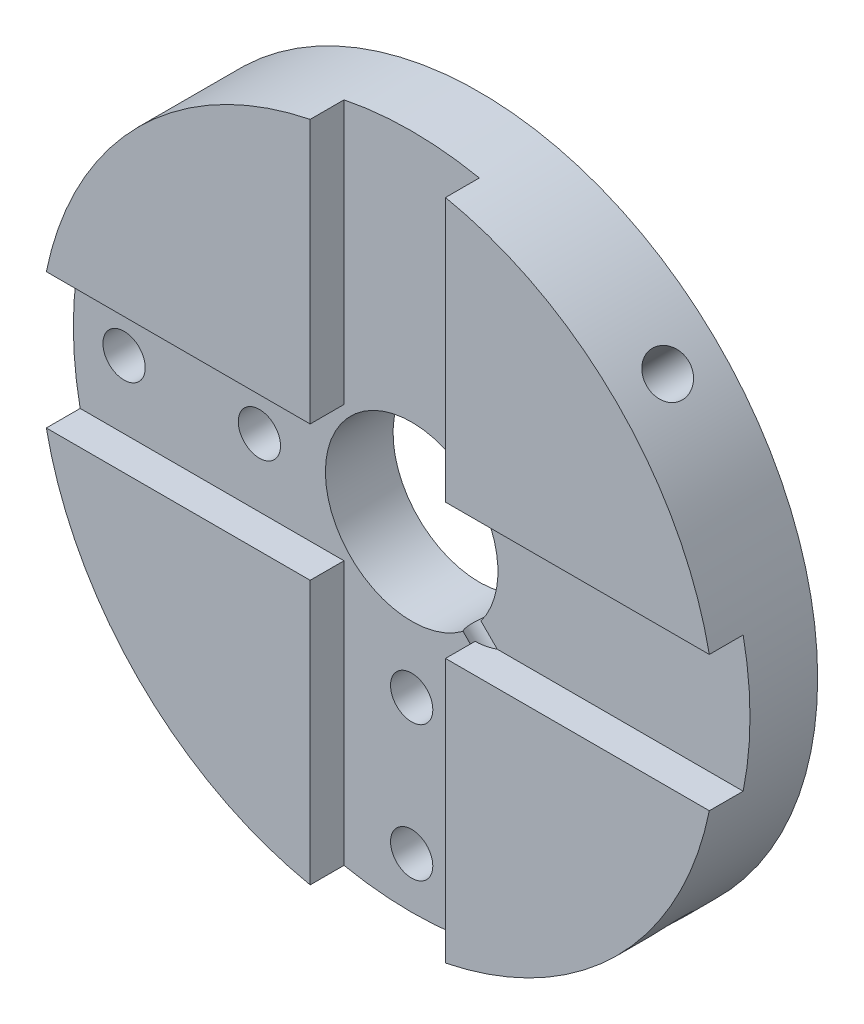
ISO-10303-21;
HEADER;
FILE_DESCRIPTION(('STEP AP214'),'2;1');
FILE_NAME('part.step','',(''),(''),'','','');
FILE_SCHEMA(('AUTOMOTIVE_DESIGN { 1 0 10303 214 1 1 1 1 }'));
ENDSEC;
DATA;
#1=APPLICATION_CONTEXT('core data for automotive mechanical design processes');
#2=APPLICATION_PROTOCOL_DEFINITION('international standard','automotive_design',2000,#1);
#3=PRODUCT_CONTEXT('',#1,'mechanical');
#4=PRODUCT('Part','Part','',(#3));
#5=PRODUCT_RELATED_PRODUCT_CATEGORY('part','',(#4));
#6=PRODUCT_DEFINITION_FORMATION('','',#4);
#7=PRODUCT_DEFINITION_CONTEXT('part definition',#1,'design');
#8=PRODUCT_DEFINITION('design','',#6,#7);
#9=PRODUCT_DEFINITION_SHAPE('','',#8);
#10=(LENGTH_UNIT() NAMED_UNIT(*) SI_UNIT(.MILLI.,.METRE.));
#11=(NAMED_UNIT(*) PLANE_ANGLE_UNIT() SI_UNIT($,.RADIAN.));
#12=(NAMED_UNIT(*) SI_UNIT($,.STERADIAN.) SOLID_ANGLE_UNIT());
#13=UNCERTAINTY_MEASURE_WITH_UNIT(LENGTH_MEASURE(1.E-05),#10,'distance_accuracy_value','');
#14=(GEOMETRIC_REPRESENTATION_CONTEXT(3) GLOBAL_UNCERTAINTY_ASSIGNED_CONTEXT((#13)) GLOBAL_UNIT_ASSIGNED_CONTEXT((#10,
#11,#12)) REPRESENTATION_CONTEXT('',''));
#15=CARTESIAN_POINT('',(0.,0.,0.));
#16=DIRECTION('',(0.,0.,1.));
#17=DIRECTION('',(1.,0.,0.));
#18=AXIS2_PLACEMENT_3D('',#15,#16,#17);
#19=CARTESIAN_POINT('',(0.,0.,8.));
#20=DIRECTION('',(0.,0.,-1.));
#21=DIRECTION('',(-1.,0.,0.));
#22=AXIS2_PLACEMENT_3D('',#19,#20,#21);
#23=PLANE('',#22);
#24=DIRECTION('',(-1.,0.,0.));
#25=VECTOR('',#24,1.);
#26=CARTESIAN_POINT('',(-23.0990360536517,4.00000000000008,8.));
#27=LINE('',#26,#25);
#28=CARTESIAN_POINT('',(19.5959179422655,3.99999999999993,8.));
#29=VERTEX_POINT('',#28);
#30=CARTESIAN_POINT('',(5.06066017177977,4.,8.));
#31=VERTEX_POINT('',#30);
#32=EDGE_CURVE('E142',#29,#31,#27,.T.);
#33=ORIENTED_EDGE('',*,*,#32,.T.);
#34=DIRECTION('',(-0.707106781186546,-0.707106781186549,0.));
#35=VECTOR('',#34,1.);
#36=CARTESIAN_POINT('',(0.530330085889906,-0.530330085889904,8.));
#37=LINE('',#36,#35);
#38=CARTESIAN_POINT('',(4.09736667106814,3.03670649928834,8.));
#39=VERTEX_POINT('',#38);
#40=EDGE_CURVE('E135',#31,#39,#37,.T.);
#41=ORIENTED_EDGE('',*,*,#40,.T.);
#42=CARTESIAN_POINT('',(0.,0.,8.));
#43=DIRECTION('',(0.,0.,-1.));
#44=DIRECTION('',(-1.,0.,0.));
#45=AXIS2_PLACEMENT_3D('',#42,#43,#44);
#46=CIRCLE('',#45,5.1);
#47=CARTESIAN_POINT('',(4.09736667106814,-3.03670649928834,8.));
#48=VERTEX_POINT('',#47);
#49=EDGE_CURVE('E44',#39,#48,#46,.T.);
#50=ORIENTED_EDGE('',*,*,#49,.T.);
#51=DIRECTION('',(-0.707106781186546,0.707106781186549,0.));
#52=VECTOR('',#51,1.);
#53=CARTESIAN_POINT('',(0.530330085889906,0.530330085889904,8.));
#54=LINE('',#53,#52);
#55=CARTESIAN_POINT('',(5.06066017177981,-4.,8.));
#56=VERTEX_POINT('',#55);
#57=EDGE_CURVE('E227',#48,#56,#54,.F.);
#58=ORIENTED_EDGE('',*,*,#57,.T.);
#59=DIRECTION('',(1.,0.,0.));
#60=VECTOR('',#59,1.);
#61=CARTESIAN_POINT('',(-23.0990360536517,-3.99999999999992,8.));
#62=LINE('',#61,#60);
#63=CARTESIAN_POINT('',(19.5959179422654,-4.00000000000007,8.));
#64=VERTEX_POINT('',#63);
#65=EDGE_CURVE('E329',#56,#64,#62,.T.);
#66=ORIENTED_EDGE('',*,*,#65,.T.);
#67=CARTESIAN_POINT('',(0.,0.,8.));
#68=DIRECTION('',(0.,0.,-1.));
#69=DIRECTION('',(-1.,0.,0.));
#70=AXIS2_PLACEMENT_3D('',#67,#68,#69);
#71=CIRCLE('',#70,20.);
#72=EDGE_CURVE('E309',#29,#64,#71,.T.);
#73=ORIENTED_EDGE('',*,*,#72,.F.);
#74=EDGE_LOOP('',(#33,#41,#50,#58,#66,#73));
#75=FACE_BOUND('',#74,.T.);
#76=ADVANCED_FACE('F16',(#75),#23,.F.);
#77=CARTESIAN_POINT('',(-2.41055287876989E-13,-9.,8.));
#78=DIRECTION('',(0.,0.,1.));
#79=DIRECTION('',(1.,0.,0.));
#80=AXIS2_PLACEMENT_3D('',#77,#78,#79);
#81=CIRCLE('',#80,1.25);
#82=CARTESIAN_POINT('',(1.24999999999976,-9.,8.));
#83=VERTEX_POINT('',#82);
#84=EDGE_CURVE('E166',#83,#83,#81,.T.);
#85=ORIENTED_EDGE('',*,*,#84,.F.);
#86=EDGE_LOOP('',(#85));
#87=FACE_BOUND('',#86,.T.);
#88=CARTESIAN_POINT('',(-3.26849241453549E-13,-17.,8.));
#89=DIRECTION('',(0.,0.,1.));
#90=DIRECTION('',(1.,0.,0.));
#91=AXIS2_PLACEMENT_3D('',#88,#89,#90);
#92=CIRCLE('',#91,1.25);
#93=CARTESIAN_POINT('',(1.24999999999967,-17.,8.));
#94=VERTEX_POINT('',#93);
#95=EDGE_CURVE('E165',#94,#94,#92,.T.);
#96=ORIENTED_EDGE('',*,*,#95,.F.);
#97=EDGE_LOOP('',(#96));
#98=FACE_BOUND('',#97,.T.);
#99=CARTESIAN_POINT('',(-9.,1.46785291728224E-13,8.));
#100=DIRECTION('',(0.,0.,1.));
#101=DIRECTION('',(1.,0.,0.));
#102=AXIS2_PLACEMENT_3D('',#99,#100,#101);
#103=CIRCLE('',#102,1.25);
#104=CARTESIAN_POINT('',(-7.75,1.46785291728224E-13,8.));
#105=VERTEX_POINT('',#104);
#106=EDGE_CURVE('E170',#105,#105,#103,.T.);
#107=ORIENTED_EDGE('',*,*,#106,.F.);
#108=EDGE_LOOP('',(#107));
#109=FACE_BOUND('',#108,.T.);
#110=CARTESIAN_POINT('',(3.03670649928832,-4.09736667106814,8.));
#111=VERTEX_POINT('',#110);
#112=CARTESIAN_POINT('',(3.03670649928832,4.09736667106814,8.));
#113=VERTEX_POINT('',#112);
#114=EDGE_CURVE('E149',#111,#113,#46,.T.);
#115=ORIENTED_EDGE('',*,*,#114,.T.);
#116=DIRECTION('',(-0.707106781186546,-0.707106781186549,0.));
#117=VECTOR('',#116,1.);
#118=CARTESIAN_POINT('',(-0.530330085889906,0.530330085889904,8.));
#119=LINE('',#118,#117);
#120=CARTESIAN_POINT('',(4.,5.06066017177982,8.));
#121=VERTEX_POINT('',#120);
#122=EDGE_CURVE('E36',#113,#121,#119,.F.);
#123=ORIENTED_EDGE('',*,*,#122,.T.);
#124=DIRECTION('',(0.,1.,0.));
#125=VECTOR('',#124,1.);
#126=CARTESIAN_POINT('',(4.,-23.0990360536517,8.));
#127=LINE('',#126,#125);
#128=CARTESIAN_POINT('',(4.,19.5959179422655,8.));
#129=VERTEX_POINT('',#128);
#130=EDGE_CURVE('E249',#121,#129,#127,.T.);
#131=ORIENTED_EDGE('',*,*,#130,.T.);
#132=CARTESIAN_POINT('',(0.,0.,8.));
#133=DIRECTION('',(0.,0.,-1.));
#134=DIRECTION('',(-1.,0.,0.));
#135=AXIS2_PLACEMENT_3D('',#132,#133,#134);
#136=CIRCLE('',#135,20.);
#137=CARTESIAN_POINT('',(-4.,19.5959179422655,8.));
#138=VERTEX_POINT('',#137);
#139=EDGE_CURVE('E266',#138,#129,#136,.T.);
#140=ORIENTED_EDGE('',*,*,#139,.F.);
#141=DIRECTION('',(0.,-1.,0.));
#142=VECTOR('',#141,1.);
#143=CARTESIAN_POINT('',(-4.,-23.0990360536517,8.));
#144=LINE('',#143,#142);
#145=CARTESIAN_POINT('',(-4.,4.,8.));
#146=VERTEX_POINT('',#145);
#147=EDGE_CURVE('E251',#138,#146,#144,.T.);
#148=ORIENTED_EDGE('',*,*,#147,.T.);
#149=CARTESIAN_POINT('',(-19.5959179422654,4.00000000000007,8.));
#150=VERTEX_POINT('',#149);
#151=EDGE_CURVE('E291',#146,#150,#27,.T.);
#152=ORIENTED_EDGE('',*,*,#151,.T.);
#153=CARTESIAN_POINT('',(-19.5959179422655,-3.99999999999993,8.));
#154=VERTEX_POINT('',#153);
#155=EDGE_CURVE('E306',#154,#150,#71,.T.);
#156=ORIENTED_EDGE('',*,*,#155,.F.);
#157=CARTESIAN_POINT('',(-4.,-4.,8.));
#158=VERTEX_POINT('',#157);
#159=EDGE_CURVE('E320',#154,#158,#62,.T.);
#160=ORIENTED_EDGE('',*,*,#159,.T.);
#161=CARTESIAN_POINT('',(-4.,-19.5959179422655,8.));
#162=VERTEX_POINT('',#161);
#163=EDGE_CURVE('E248',#158,#162,#144,.T.);
#164=ORIENTED_EDGE('',*,*,#163,.T.);
#165=CARTESIAN_POINT('',(4.,-19.5959179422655,8.));
#166=VERTEX_POINT('',#165);
#167=EDGE_CURVE('E247',#166,#162,#136,.T.);
#168=ORIENTED_EDGE('',*,*,#167,.F.);
#169=CARTESIAN_POINT('',(4.,-5.06066017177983,8.));
#170=VERTEX_POINT('',#169);
#171=EDGE_CURVE('E240',#166,#170,#127,.T.);
#172=ORIENTED_EDGE('',*,*,#171,.T.);
#173=DIRECTION('',(-0.707106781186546,0.707106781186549,0.));
#174=VECTOR('',#173,1.);
#175=CARTESIAN_POINT('',(-0.530330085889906,-0.530330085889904,8.));
#176=LINE('',#175,#174);
#177=EDGE_CURVE('E229',#170,#111,#176,.T.);
#178=ORIENTED_EDGE('',*,*,#177,.T.);
#179=EDGE_LOOP('',(#115,#123,#131,#140,#148,#152,#156,#160,#164,#168,#172,#178));
#180=FACE_BOUND('',#179,.T.);
#181=CARTESIAN_POINT('',(-17.,1.48783693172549E-13,8.));
#182=DIRECTION('',(0.,0.,1.));
#183=DIRECTION('',(1.,0.,0.));
#184=AXIS2_PLACEMENT_3D('',#181,#182,#183);
#185=CIRCLE('',#184,1.25);
#186=CARTESIAN_POINT('',(-15.75,1.48783693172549E-13,8.));
#187=VERTEX_POINT('',#186);
#188=EDGE_CURVE('E174',#187,#187,#185,.T.);
#189=ORIENTED_EDGE('',*,*,#188,.F.);
#190=EDGE_LOOP('',(#189));
#191=FACE_BOUND('',#190,.T.);
#192=ADVANCED_FACE('F244',(#87,#98,#109,#180,#191),#23,.F.);
#193=CARTESIAN_POINT('',(0.,0.,10.));
#194=DIRECTION('',(0.,0.,1.));
#195=DIRECTION('',(1.,0.,0.));
#196=AXIS2_PLACEMENT_3D('',#193,#194,#195);
#197=PLANE('',#196);
#198=DIRECTION('',(1.,0.,0.));
#199=VECTOR('',#198,1.);
#200=CARTESIAN_POINT('',(-23.0990360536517,-3.99999999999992,10.));
#201=LINE('',#200,#199);
#202=CARTESIAN_POINT('',(4.,-4.,10.));
#203=VERTEX_POINT('',#202);
#204=CARTESIAN_POINT('',(19.5959179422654,-4.00000000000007,10.));
#205=VERTEX_POINT('',#204);
#206=EDGE_CURVE('E178',#203,#205,#201,.T.);
#207=ORIENTED_EDGE('',*,*,#206,.F.);
#208=DIRECTION('',(0.,1.,0.));
#209=VECTOR('',#208,1.);
#210=CARTESIAN_POINT('',(4.,-23.0990360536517,10.));
#211=LINE('',#210,#209);
#212=CARTESIAN_POINT('',(4.,-19.5959179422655,10.));
#213=VERTEX_POINT('',#212);
#214=EDGE_CURVE('E261',#213,#203,#211,.T.);
#215=ORIENTED_EDGE('',*,*,#214,.F.);
#216=CARTESIAN_POINT('',(0.,0.,10.));
#217=DIRECTION('',(0.,0.,1.));
#218=DIRECTION('',(1.,0.,0.));
#219=AXIS2_PLACEMENT_3D('',#216,#217,#218);
#220=CIRCLE('',#219,20.);
#221=EDGE_CURVE('E156',#213,#205,#220,.T.);
#222=ORIENTED_EDGE('',*,*,#221,.T.);
#223=EDGE_LOOP('',(#207,#215,#222));
#224=FACE_BOUND('',#223,.T.);
#225=ADVANCED_FACE('F284',(#224),#197,.T.);
#226=CARTESIAN_POINT('',(-19.5959179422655,-3.99999999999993,10.));
#227=VERTEX_POINT('',#226);
#228=CARTESIAN_POINT('',(-4.,-4.,10.));
#229=VERTEX_POINT('',#228);
#230=EDGE_CURVE('E286',#227,#229,#201,.T.);
#231=ORIENTED_EDGE('',*,*,#230,.F.);
#232=CARTESIAN_POINT('',(-4.,-19.5959179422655,10.));
#233=VERTEX_POINT('',#232);
#234=EDGE_CURVE('E154',#227,#233,#220,.T.);
#235=ORIENTED_EDGE('',*,*,#234,.T.);
#236=DIRECTION('',(0.,-1.,0.));
#237=VECTOR('',#236,1.);
#238=CARTESIAN_POINT('',(-4.,-23.0990360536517,10.));
#239=LINE('',#238,#237);
#240=EDGE_CURVE('E262',#229,#233,#239,.T.);
#241=ORIENTED_EDGE('',*,*,#240,.F.);
#242=EDGE_LOOP('',(#231,#235,#241));
#243=FACE_BOUND('',#242,.T.);
#244=ADVANCED_FACE('F323',(#243),#197,.T.);
#245=DIRECTION('',(-1.,0.,0.));
#246=VECTOR('',#245,1.);
#247=CARTESIAN_POINT('',(-23.0990360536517,4.00000000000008,10.));
#248=LINE('',#247,#246);
#249=CARTESIAN_POINT('',(19.5959179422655,3.99999999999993,10.));
#250=VERTEX_POINT('',#249);
#251=CARTESIAN_POINT('',(4.,4.,10.));
#252=VERTEX_POINT('',#251);
#253=EDGE_CURVE('E294',#250,#252,#248,.T.);
#254=ORIENTED_EDGE('',*,*,#253,.F.);
#255=CARTESIAN_POINT('',(4.,19.5959179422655,10.));
#256=VERTEX_POINT('',#255);
#257=EDGE_CURVE('E157',#250,#256,#220,.T.);
#258=ORIENTED_EDGE('',*,*,#257,.T.);
#259=EDGE_CURVE('E258',#252,#256,#211,.T.);
#260=ORIENTED_EDGE('',*,*,#259,.F.);
#261=EDGE_LOOP('',(#254,#258,#260));
#262=FACE_BOUND('',#261,.T.);
#263=ADVANCED_FACE('F409',(#262),#197,.T.);
#264=CARTESIAN_POINT('',(-4.,4.,10.));
#265=VERTEX_POINT('',#264);
#266=CARTESIAN_POINT('',(-19.5959179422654,4.00000000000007,10.));
#267=VERTEX_POINT('',#266);
#268=EDGE_CURVE('E288',#265,#267,#248,.T.);
#269=ORIENTED_EDGE('',*,*,#268,.F.);
#270=CARTESIAN_POINT('',(-4.,19.5959179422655,10.));
#271=VERTEX_POINT('',#270);
#272=EDGE_CURVE('E253',#271,#265,#239,.T.);
#273=ORIENTED_EDGE('',*,*,#272,.F.);
#274=EDGE_CURVE('E150',#271,#267,#220,.T.);
#275=ORIENTED_EDGE('',*,*,#274,.T.);
#276=EDGE_LOOP('',(#269,#273,#275));
#277=FACE_BOUND('',#276,.T.);
#278=ADVANCED_FACE('F217',(#277),#197,.T.);
#279=CARTESIAN_POINT('',(0.,0.,4.));
#280=DIRECTION('',(0.,0.,1.));
#281=DIRECTION('',(1.,0.,0.));
#282=AXIS2_PLACEMENT_3D('',#279,#280,#281);
#283=PLANE('',#282);
#284=CARTESIAN_POINT('',(-2.41055287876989E-13,-9.,4.));
#285=DIRECTION('',(0.,0.,1.));
#286=DIRECTION('',(1.,0.,0.));
#287=AXIS2_PLACEMENT_3D('',#284,#285,#286);
#288=CIRCLE('',#287,1.25);
#289=CARTESIAN_POINT('',(1.24999999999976,-9.,4.));
#290=VERTEX_POINT('',#289);
#291=EDGE_CURVE('E162',#290,#290,#288,.T.);
#292=ORIENTED_EDGE('',*,*,#291,.T.);
#293=EDGE_LOOP('',(#292));
#294=FACE_BOUND('',#293,.T.);
#295=CARTESIAN_POINT('',(-3.26849241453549E-13,-17.,4.));
#296=DIRECTION('',(0.,0.,1.));
#297=DIRECTION('',(1.,0.,0.));
#298=AXIS2_PLACEMENT_3D('',#295,#296,#297);
#299=CIRCLE('',#298,1.25);
#300=CARTESIAN_POINT('',(1.24999999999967,-17.,4.));
#301=VERTEX_POINT('',#300);
#302=EDGE_CURVE('E167',#301,#301,#299,.T.);
#303=ORIENTED_EDGE('',*,*,#302,.T.);
#304=EDGE_LOOP('',(#303));
#305=FACE_BOUND('',#304,.T.);
#306=CARTESIAN_POINT('',(-9.,1.46785291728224E-13,4.));
#307=DIRECTION('',(0.,0.,1.));
#308=DIRECTION('',(1.,0.,0.));
#309=AXIS2_PLACEMENT_3D('',#306,#307,#308);
#310=CIRCLE('',#309,1.25);
#311=CARTESIAN_POINT('',(-7.75,1.46785291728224E-13,4.));
#312=VERTEX_POINT('',#311);
#313=EDGE_CURVE('E171',#312,#312,#310,.T.);
#314=ORIENTED_EDGE('',*,*,#313,.T.);
#315=EDGE_LOOP('',(#314));
#316=FACE_BOUND('',#315,.T.);
#317=CARTESIAN_POINT('',(-17.,1.48783693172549E-13,4.));
#318=DIRECTION('',(0.,0.,1.));
#319=DIRECTION('',(1.,0.,0.));
#320=AXIS2_PLACEMENT_3D('',#317,#318,#319);
#321=CIRCLE('',#320,1.25);
#322=CARTESIAN_POINT('',(-15.75,1.48783693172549E-13,4.));
#323=VERTEX_POINT('',#322);
#324=EDGE_CURVE('E175',#323,#323,#321,.T.);
#325=ORIENTED_EDGE('',*,*,#324,.T.);
#326=EDGE_LOOP('',(#325));
#327=FACE_BOUND('',#326,.T.);
#328=CARTESIAN_POINT('',(0.,0.,4.));
#329=DIRECTION('',(0.,0.,1.));
#330=DIRECTION('',(1.,0.,0.));
#331=AXIS2_PLACEMENT_3D('',#328,#329,#330);
#332=CIRCLE('',#331,20.);
#333=CARTESIAN_POINT('',(20.,0.,4.));
#334=VERTEX_POINT('',#333);
#335=EDGE_CURVE('E179',#334,#334,#332,.T.);
#336=ORIENTED_EDGE('',*,*,#335,.F.);
#337=EDGE_LOOP('',(#336));
#338=FACE_BOUND('',#337,.T.);
#339=CARTESIAN_POINT('',(0.,0.,4.));
#340=DIRECTION('',(0.,0.,1.));
#341=DIRECTION('',(1.,0.,0.));
#342=AXIS2_PLACEMENT_3D('',#339,#340,#341);
#343=CIRCLE('',#342,5.1);
#344=CARTESIAN_POINT('',(5.1,0.,4.));
#345=VERTEX_POINT('',#344);
#346=EDGE_CURVE('E182',#345,#345,#343,.T.);
#347=ORIENTED_EDGE('',*,*,#346,.T.);
#348=EDGE_LOOP('',(#347));
#349=FACE_BOUND('',#348,.T.);
#350=ADVANCED_FACE('F18',(#294,#305,#316,#327,#338,#349),#283,.F.);
#351=CARTESIAN_POINT('',(0.,0.,10.));
#352=DIRECTION('',(0.,0.,-1.));
#353=DIRECTION('',(-1.,0.,0.));
#354=AXIS2_PLACEMENT_3D('',#351,#352,#353);
#355=CYLINDRICAL_SURFACE('',#354,20.);
#356=CARTESIAN_POINT('',(14.9983707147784,13.2306037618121,7.));
#357=CARTESIAN_POINT('',(14.9983689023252,13.2306063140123,7.07013944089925));
#358=CARTESIAN_POINT('',(14.9944465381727,13.2350563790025,7.14032799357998));
#359=CARTESIAN_POINT('',(14.9788340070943,13.2527229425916,7.27876701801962));
#360=CARTESIAN_POINT('',(14.9671347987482,13.2659496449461,7.34701513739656));
#361=CARTESIAN_POINT('',(14.9362411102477,13.3007232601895,7.4795479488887));
#362=CARTESIAN_POINT('',(14.917050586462,13.3222657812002,7.54383471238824));
#363=CARTESIAN_POINT('',(14.8716263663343,13.3729533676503,7.6666442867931));
#364=CARTESIAN_POINT('',(14.8453942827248,13.4020966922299,7.72516841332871));
#365=CARTESIAN_POINT('',(14.7864657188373,13.4670840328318,7.83489620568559));
#366=CARTESIAN_POINT('',(14.7537607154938,13.5029368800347,7.88609006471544));
#367=CARTESIAN_POINT('',(14.6826984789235,13.5801735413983,7.97962019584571));
#368=CARTESIAN_POINT('',(14.6443410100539,13.6215575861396,8.02195609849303));
#369=CARTESIAN_POINT('',(14.5628975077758,13.708594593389,8.09659846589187));
#370=CARTESIAN_POINT('',(14.5198077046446,13.7542509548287,8.12889685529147));
#371=CARTESIAN_POINT('',(14.4300380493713,13.8484016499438,8.18249564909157));
#372=CARTESIAN_POINT('',(14.383358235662,13.8968959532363,8.20379617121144));
#373=CARTESIAN_POINT('',(14.2877226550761,13.9952018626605,8.23476748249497));
#374=CARTESIAN_POINT('',(14.2387699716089,14.0450116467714,8.24445357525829));
#375=CARTESIAN_POINT('',(14.1398886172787,14.1445562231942,8.25196833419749));
#376=CARTESIAN_POINT('',(14.0899599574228,14.194291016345,8.24979713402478));
#377=CARTESIAN_POINT('',(13.9906259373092,14.2922092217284,8.23367156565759));
#378=CARTESIAN_POINT('',(13.9412199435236,14.3403947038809,8.21973366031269));
#379=CARTESIAN_POINT('',(13.8443117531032,14.4339728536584,8.18049587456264));
#380=CARTESIAN_POINT('',(13.7968095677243,14.479365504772,8.15519592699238));
#381=CARTESIAN_POINT('',(13.7051076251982,14.5661944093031,8.09393358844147));
#382=CARTESIAN_POINT('',(13.6609102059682,14.6076278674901,8.05796373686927));
#383=CARTESIAN_POINT('',(13.5772167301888,14.6854505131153,7.97638807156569));
#384=CARTESIAN_POINT('',(13.5377207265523,14.721839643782,7.93078214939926));
#385=CARTESIAN_POINT('',(13.4646108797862,14.7887362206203,7.83113594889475));
#386=CARTESIAN_POINT('',(13.4310072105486,14.8192335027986,7.77708138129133));
#387=CARTESIAN_POINT('',(13.3708479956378,14.8735359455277,7.66212236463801));
#388=CARTESIAN_POINT('',(13.3442924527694,14.8973411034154,7.60121791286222));
#389=CARTESIAN_POINT('',(13.2991002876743,14.9376990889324,7.47427884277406));
#390=CARTESIAN_POINT('',(13.2804641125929,14.9542515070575,7.40824393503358));
#391=CARTESIAN_POINT('',(13.2517353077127,14.9797157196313,7.27292263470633));
#392=CARTESIAN_POINT('',(13.2416425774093,14.9886276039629,7.20363628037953));
#393=CARTESIAN_POINT('',(13.230350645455,14.9985959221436,7.06390431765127));
#394=CARTESIAN_POINT('',(13.2291364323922,14.9996656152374,6.99346086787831));
#395=CARTESIAN_POINT('',(13.2356028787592,14.9939599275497,6.85330407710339));
#396=CARTESIAN_POINT('',(13.2432834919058,14.9871845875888,6.78359073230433));
#397=CARTESIAN_POINT('',(13.2672708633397,14.9659539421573,6.64692958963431));
#398=CARTESIAN_POINT('',(13.2835707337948,14.9515047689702,6.5799796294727));
#399=CARTESIAN_POINT('',(13.3242489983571,14.9152648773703,6.45067898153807));
#400=CARTESIAN_POINT('',(13.3486274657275,14.8934740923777,6.38832833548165));
#401=CARTESIAN_POINT('',(13.4047000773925,14.8430264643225,6.26990439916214));
#402=CARTESIAN_POINT('',(13.4364039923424,14.8143604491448,6.21383964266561));
#403=CARTESIAN_POINT('',(13.5060846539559,14.7508607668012,6.10966492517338));
#404=CARTESIAN_POINT('',(13.5440614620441,14.7160270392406,6.06155504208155));
#405=CARTESIAN_POINT('',(13.6251408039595,14.64098997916,5.97458821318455));
#406=CARTESIAN_POINT('',(13.6682503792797,14.6007792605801,5.93574420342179));
#407=CARTESIAN_POINT('',(13.7582105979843,14.516041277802,5.86850028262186));
#408=CARTESIAN_POINT('',(13.805061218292,14.4715140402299,5.8401003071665));
#409=CARTESIAN_POINT('',(13.9010412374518,14.3793418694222,5.79457312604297));
#410=CARTESIAN_POINT('',(13.9501689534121,14.3316992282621,5.77743773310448));
#411=CARTESIAN_POINT('',(14.0492748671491,14.2345596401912,5.75489933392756));
#412=CARTESIAN_POINT('',(14.0992530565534,14.1850627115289,5.74949621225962));
#413=CARTESIAN_POINT('',(14.1985304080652,14.0856898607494,5.75057685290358));
#414=CARTESIAN_POINT('',(14.24783058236,14.035814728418,5.75704037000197));
#415=CARTESIAN_POINT('',(14.3444630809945,13.9370425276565,5.78162883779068));
#416=CARTESIAN_POINT('',(14.3917954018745,13.888145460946,5.79975380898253));
#417=CARTESIAN_POINT('',(14.4832164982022,13.7927809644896,5.84714612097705));
#418=CARTESIAN_POINT('',(14.5273052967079,13.7463135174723,5.8764133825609));
#419=CARTESIAN_POINT('',(14.6110940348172,13.6572206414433,5.94525665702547));
#420=CARTESIAN_POINT('',(14.6507940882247,13.6145951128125,5.98483240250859));
#421=CARTESIAN_POINT('',(14.7248710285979,13.5344435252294,6.07324399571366));
#422=CARTESIAN_POINT('',(14.7592393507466,13.4969256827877,6.12209446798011));
#423=CARTESIAN_POINT('',(14.8217465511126,13.4282534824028,6.22764940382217));
#424=CARTESIAN_POINT('',(14.8498839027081,13.3971006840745,6.28435578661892));
#425=CARTESIAN_POINT('',(14.8992782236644,13.3421467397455,6.40407768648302));
#426=CARTESIAN_POINT('',(14.9205266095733,13.3183547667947,6.46710094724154));
#427=CARTESIAN_POINT('',(14.9555773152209,13.2789837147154,6.5975656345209));
#428=CARTESIAN_POINT('',(14.9693883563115,13.2633950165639,6.66500178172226));
#429=CARTESIAN_POINT('',(14.9856600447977,13.2450019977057,6.77737541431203));
#430=CARTESIAN_POINT('',(14.990421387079,13.2396106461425,6.82158651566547));
#431=CARTESIAN_POINT('',(14.9967772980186,13.2324107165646,6.91052508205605));
#432=CARTESIAN_POINT('',(14.9983718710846,13.2306021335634,6.95525254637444));
#433=CARTESIAN_POINT('',(14.9983707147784,13.2306037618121,7.));
#434=B_SPLINE_CURVE_WITH_KNOTS('',3,(#356,#357,#358,#359,#360,#361,#362,#363,#364,#365,#366,
#367,#368,#369,#370,#371,#372,#373,#374,#375,#376,#377,#378,#379,#380,#381,#382,#383,#384,#385,
#386,#387,#388,#389,#390,#391,#392,#393,#394,#395,#396,#397,#398,#399,#400,#401,#402,#403,#404,
#405,#406,#407,#408,#409,#410,#411,#412,#413,#414,#415,#416,#417,#418,#419,#420,#421,#422,#423,
#424,#425,#426,#427,#428,#429,#430,#431,#432,#433),.UNSPECIFIED.,.T.,.F.,(4,2,2,2,2,2,2,2,2,2,2,
2,2,2,2,2,2,2,2,2,2,2,2,2,2,2,2,2,2,2,2,2,2,2,2,2,2,2,4),(0.,0.21025496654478,0.420754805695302,
0.631143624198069,0.841484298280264,1.05210379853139,1.26273208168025,1.4735293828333,
1.68432442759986,1.89484141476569,2.10535602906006,2.31557659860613,2.5257984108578,
2.73616756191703,2.9465390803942,3.15727033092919,3.36800166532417,3.57874489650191,
3.78948564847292,3.99987000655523,4.21025326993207,4.42046866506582,4.63068596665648,
4.8411852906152,5.05168667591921,5.26248024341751,5.47327251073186,5.68391140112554,
5.89454821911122,6.10482601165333,6.31510417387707,6.52538084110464,6.73565205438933,
6.94625762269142,7.15691473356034,7.36783331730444,7.57850402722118,7.71264235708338,
7.84678050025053),.UNSPECIFIED.);
#435=CARTESIAN_POINT('',(14.9983707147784,13.2306037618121,7.));
#436=VERTEX_POINT('',#435);
#437=EDGE_CURVE('E220',#436,#436,#434,.T.);
#438=ORIENTED_EDGE('',*,*,#437,.T.);
#439=EDGE_LOOP('',(#438));
#440=FACE_BOUND('',#439,.T.);
#441=CARTESIAN_POINT('',(13.2306037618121,-14.9983707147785,7.));
#442=CARTESIAN_POINT('',(13.2306063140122,-14.9983689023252,7.07013944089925));
#443=CARTESIAN_POINT('',(13.2350563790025,-14.9944465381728,7.14032799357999));
#444=CARTESIAN_POINT('',(13.2527229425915,-14.9788340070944,7.27876701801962));
#445=CARTESIAN_POINT('',(13.2659496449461,-14.9671347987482,7.34701513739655));
#446=CARTESIAN_POINT('',(13.3007232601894,-14.9362411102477,7.4795479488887));
#447=CARTESIAN_POINT('',(13.3222657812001,-14.917050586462,7.54383471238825));
#448=CARTESIAN_POINT('',(13.3729533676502,-14.8716263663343,7.66664428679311));
#449=CARTESIAN_POINT('',(13.4020966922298,-14.8453942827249,7.72516841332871));
#450=CARTESIAN_POINT('',(13.4670840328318,-14.7864657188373,7.83489620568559));
#451=CARTESIAN_POINT('',(13.5029368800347,-14.7537607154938,7.88609006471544));
#452=CARTESIAN_POINT('',(13.5801735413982,-14.6826984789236,7.97962019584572));
#453=CARTESIAN_POINT('',(13.6215575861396,-14.644341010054,8.02195609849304));
#454=CARTESIAN_POINT('',(13.708594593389,-14.5628975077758,8.09659846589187));
#455=CARTESIAN_POINT('',(13.7542509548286,-14.5198077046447,8.12889685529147));
#456=CARTESIAN_POINT('',(13.8484016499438,-14.4300380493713,8.18249564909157));
#457=CARTESIAN_POINT('',(13.8968959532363,-14.3833582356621,8.20379617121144));
#458=CARTESIAN_POINT('',(13.9952018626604,-14.2877226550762,8.23476748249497));
#459=CARTESIAN_POINT('',(14.0450116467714,-14.238769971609,8.24445357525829));
#460=CARTESIAN_POINT('',(14.1445562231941,-14.1398886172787,8.2519683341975));
#461=CARTESIAN_POINT('',(14.1942910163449,-14.0899599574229,8.24979713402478));
#462=CARTESIAN_POINT('',(14.2922092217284,-13.9906259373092,8.23367156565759));
#463=CARTESIAN_POINT('',(14.3403947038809,-13.9412199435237,8.21973366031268));
#464=CARTESIAN_POINT('',(14.4339728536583,-13.8443117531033,8.18049587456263));
#465=CARTESIAN_POINT('',(14.4793655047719,-13.7968095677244,8.15519592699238));
#466=CARTESIAN_POINT('',(14.5661944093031,-13.7051076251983,8.09393358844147));
#467=CARTESIAN_POINT('',(14.60762786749,-13.6609102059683,8.05796373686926));
#468=CARTESIAN_POINT('',(14.6854505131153,-13.5772167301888,7.97638807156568));
#469=CARTESIAN_POINT('',(14.7218396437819,-13.5377207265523,7.93078214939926));
#470=CARTESIAN_POINT('',(14.7887362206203,-13.4646108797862,7.83113594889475));
#471=CARTESIAN_POINT('',(14.8192335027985,-13.4310072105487,7.77708138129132));
#472=CARTESIAN_POINT('',(14.8735359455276,-13.3708479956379,7.662122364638));
#473=CARTESIAN_POINT('',(14.8973411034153,-13.3442924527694,7.60121791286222));
#474=CARTESIAN_POINT('',(14.9376990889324,-13.2991002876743,7.47427884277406));
#475=CARTESIAN_POINT('',(14.9542515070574,-13.2804641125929,7.40824393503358));
#476=CARTESIAN_POINT('',(14.9797157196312,-13.2517353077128,7.27292263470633));
#477=CARTESIAN_POINT('',(14.9886276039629,-13.2416425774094,7.20363628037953));
#478=CARTESIAN_POINT('',(14.9985959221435,-13.230350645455,7.06390431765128));
#479=CARTESIAN_POINT('',(14.9996656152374,-13.2291364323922,6.99346086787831));
#480=CARTESIAN_POINT('',(14.9939599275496,-13.2356028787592,6.85330407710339));
#481=CARTESIAN_POINT('',(14.9871845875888,-13.2432834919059,6.78359073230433));
#482=CARTESIAN_POINT('',(14.9659539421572,-13.2672708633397,6.64692958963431));
#483=CARTESIAN_POINT('',(14.9515047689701,-13.2835707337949,6.57997962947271));
#484=CARTESIAN_POINT('',(14.9152648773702,-13.3242489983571,6.45067898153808));
#485=CARTESIAN_POINT('',(14.8934740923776,-13.3486274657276,6.38832833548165));
#486=CARTESIAN_POINT('',(14.8430264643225,-13.4047000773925,6.26990439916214));
#487=CARTESIAN_POINT('',(14.8143604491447,-13.4364039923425,6.21383964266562));
#488=CARTESIAN_POINT('',(14.7508607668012,-13.506084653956,6.10966492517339));
#489=CARTESIAN_POINT('',(14.7160270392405,-13.5440614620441,6.06155504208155));
#490=CARTESIAN_POINT('',(14.64098997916,-13.6251408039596,5.97458821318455));
#491=CARTESIAN_POINT('',(14.6007792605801,-13.6682503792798,5.9357442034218));
#492=CARTESIAN_POINT('',(14.5160412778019,-13.7582105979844,5.86850028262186));
#493=CARTESIAN_POINT('',(14.4715140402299,-13.805061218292,5.8401003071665));
#494=CARTESIAN_POINT('',(14.3793418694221,-13.9010412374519,5.79457312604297));
#495=CARTESIAN_POINT('',(14.331699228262,-13.9501689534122,5.77743773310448));
#496=CARTESIAN_POINT('',(14.2345596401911,-14.0492748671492,5.75489933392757));
#497=CARTESIAN_POINT('',(14.1850627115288,-14.0992530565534,5.74949621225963));
#498=CARTESIAN_POINT('',(14.0856898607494,-14.1985304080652,5.75057685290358));
#499=CARTESIAN_POINT('',(14.0358147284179,-14.24783058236,5.75704037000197));
#500=CARTESIAN_POINT('',(13.9370425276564,-14.3444630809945,5.78162883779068));
#501=CARTESIAN_POINT('',(13.8881454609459,-14.3917954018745,5.79975380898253));
#502=CARTESIAN_POINT('',(13.7927809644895,-14.4832164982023,5.84714612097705));
#503=CARTESIAN_POINT('',(13.7463135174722,-14.527305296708,5.87641338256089));
#504=CARTESIAN_POINT('',(13.6572206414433,-14.6110940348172,5.94525665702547));
#505=CARTESIAN_POINT('',(13.6145951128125,-14.6507940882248,5.98483240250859));
#506=CARTESIAN_POINT('',(13.5344435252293,-14.7248710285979,6.07324399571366));
#507=CARTESIAN_POINT('',(13.4969256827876,-14.7592393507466,6.1220944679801));
#508=CARTESIAN_POINT('',(13.4282534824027,-14.8217465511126,6.22764940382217));
#509=CARTESIAN_POINT('',(13.3971006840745,-14.8498839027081,6.28435578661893));
#510=CARTESIAN_POINT('',(13.3421467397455,-14.8992782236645,6.40407768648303));
#511=CARTESIAN_POINT('',(13.3183547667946,-14.9205266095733,6.46710094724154));
#512=CARTESIAN_POINT('',(13.2789837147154,-14.9555773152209,6.59756563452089));
#513=CARTESIAN_POINT('',(13.2633950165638,-14.9693883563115,6.66500178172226));
#514=CARTESIAN_POINT('',(13.2450019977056,-14.9856600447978,6.77737541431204));
#515=CARTESIAN_POINT('',(13.2396106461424,-14.990421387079,6.82158651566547));
#516=CARTESIAN_POINT('',(13.2324107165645,-14.9967772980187,6.91052508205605));
#517=CARTESIAN_POINT('',(13.2306021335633,-14.9983718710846,6.95525254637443));
#518=CARTESIAN_POINT('',(13.2306037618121,-14.9983707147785,7.));
#519=B_SPLINE_CURVE_WITH_KNOTS('',3,(#441,#442,#443,#444,#445,#446,#447,#448,#449,#450,#451,
#452,#453,#454,#455,#456,#457,#458,#459,#460,#461,#462,#463,#464,#465,#466,#467,#468,#469,#470,
#471,#472,#473,#474,#475,#476,#477,#478,#479,#480,#481,#482,#483,#484,#485,#486,#487,#488,#489,
#490,#491,#492,#493,#494,#495,#496,#497,#498,#499,#500,#501,#502,#503,#504,#505,#506,#507,#508,
#509,#510,#511,#512,#513,#514,#515,#516,#517,#518),.UNSPECIFIED.,.T.,.F.,(4,2,2,2,2,2,2,2,2,2,2,
2,2,2,2,2,2,2,2,2,2,2,2,2,2,2,2,2,2,2,2,2,2,2,2,2,2,2,4),(0.,0.210254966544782,
0.420754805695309,0.631143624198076,0.841484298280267,1.0521037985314,1.26273208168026,
1.4735293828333,1.68432442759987,1.8948414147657,2.10535602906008,2.31557659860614,
2.52579841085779,2.73616756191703,2.94653908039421,3.1572703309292,3.36800166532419,
3.57874489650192,3.78948564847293,3.99987000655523,4.21025326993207,4.42046866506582,
4.63068596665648,4.8411852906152,5.0516866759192,5.26248024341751,5.47327251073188,
5.68391140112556,5.89454821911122,6.10482601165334,6.31510417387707,6.52538084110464,
6.73565205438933,6.94625762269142,7.15691473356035,7.36783331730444,7.57850402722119,
7.71264235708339,7.84678050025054),.UNSPECIFIED.);
#520=CARTESIAN_POINT('',(13.2306037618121,-14.9983707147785,7.));
#521=VERTEX_POINT('',#520);
#522=EDGE_CURVE('E203',#521,#521,#519,.T.);
#523=ORIENTED_EDGE('',*,*,#522,.T.);
#524=EDGE_LOOP('',(#523));
#525=FACE_BOUND('',#524,.T.);
#526=ORIENTED_EDGE('',*,*,#72,.T.);
#527=DIRECTION('',(0.,0.,-1.));
#528=VECTOR('',#527,1.);
#529=CARTESIAN_POINT('',(19.5959179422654,-4.00000000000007,10.));
#530=LINE('',#529,#528);
#531=EDGE_CURVE('E312',#64,#205,#530,.F.);
#532=ORIENTED_EDGE('',*,*,#531,.T.);
#533=ORIENTED_EDGE('',*,*,#221,.F.);
#534=DIRECTION('',(0.,0.,-1.));
#535=VECTOR('',#534,1.);
#536=CARTESIAN_POINT('',(4.,-19.5959179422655,10.));
#537=LINE('',#536,#535);
#538=EDGE_CURVE('E184',#213,#166,#537,.T.);
#539=ORIENTED_EDGE('',*,*,#538,.T.);
#540=ORIENTED_EDGE('',*,*,#167,.T.);
#541=DIRECTION('',(0.,0.,-1.));
#542=VECTOR('',#541,1.);
#543=CARTESIAN_POINT('',(-4.,-19.5959179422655,10.));
#544=LINE('',#543,#542);
#545=EDGE_CURVE('E267',#162,#233,#544,.F.);
#546=ORIENTED_EDGE('',*,*,#545,.T.);
#547=ORIENTED_EDGE('',*,*,#234,.F.);
#548=DIRECTION('',(0.,0.,-1.));
#549=VECTOR('',#548,1.);
#550=CARTESIAN_POINT('',(-19.5959179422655,-3.99999999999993,10.));
#551=LINE('',#550,#549);
#552=EDGE_CURVE('E255',#227,#154,#551,.T.);
#553=ORIENTED_EDGE('',*,*,#552,.T.);
#554=ORIENTED_EDGE('',*,*,#155,.T.);
#555=DIRECTION('',(0.,0.,-1.));
#556=VECTOR('',#555,1.);
#557=CARTESIAN_POINT('',(-19.5959179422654,4.00000000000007,10.));
#558=LINE('',#557,#556);
#559=EDGE_CURVE('E300',#150,#267,#558,.F.);
#560=ORIENTED_EDGE('',*,*,#559,.T.);
#561=ORIENTED_EDGE('',*,*,#274,.F.);
#562=DIRECTION('',(0.,0.,-1.));
#563=VECTOR('',#562,1.);
#564=CARTESIAN_POINT('',(-4.,19.5959179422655,10.));
#565=LINE('',#564,#563);
#566=EDGE_CURVE('E270',#271,#138,#565,.T.);
#567=ORIENTED_EDGE('',*,*,#566,.T.);
#568=ORIENTED_EDGE('',*,*,#139,.T.);
#569=DIRECTION('',(0.,0.,-1.));
#570=VECTOR('',#569,1.);
#571=CARTESIAN_POINT('',(4.,19.5959179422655,10.));
#572=LINE('',#571,#570);
#573=EDGE_CURVE('E273',#129,#256,#572,.F.);
#574=ORIENTED_EDGE('',*,*,#573,.T.);
#575=ORIENTED_EDGE('',*,*,#257,.F.);
#576=DIRECTION('',(0.,0.,-1.));
#577=VECTOR('',#576,1.);
#578=CARTESIAN_POINT('',(19.5959179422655,3.99999999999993,10.));
#579=LINE('',#578,#577);
#580=EDGE_CURVE('E303',#250,#29,#579,.T.);
#581=ORIENTED_EDGE('',*,*,#580,.T.);
#582=EDGE_LOOP('',(#526,#532,#533,#539,#540,#546,#547,#553,#554,#560,#561,#567,#568,#574,#575,#581));
#583=FACE_BOUND('',#582,.T.);
#584=ORIENTED_EDGE('',*,*,#335,.T.);
#585=EDGE_LOOP('',(#584));
#586=FACE_BOUND('',#585,.T.);
#587=ADVANCED_FACE('F213',(#440,#525,#583,#586),#355,.T.);
#588=CARTESIAN_POINT('',(0.,0.,10.));
#589=DIRECTION('',(0.,0.,-1.));
#590=DIRECTION('',(-1.,0.,0.));
#591=AXIS2_PLACEMENT_3D('',#588,#589,#590);
#592=CYLINDRICAL_SURFACE('',#591,5.1);
#593=CARTESIAN_POINT('',(3.03670649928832,4.09736667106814,8.));
#594=CARTESIAN_POINT('',(3.01378569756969,4.11435477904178,7.97883399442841));
#595=CARTESIAN_POINT('',(2.99143994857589,4.13061725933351,7.95649241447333));
#596=CARTESIAN_POINT('',(2.94809058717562,4.16166692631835,7.90959309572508));
#597=CARTESIAN_POINT('',(2.92708694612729,4.17645414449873,7.88503540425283));
#598=CARTESIAN_POINT('',(2.86639847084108,4.21855215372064,7.80826790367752));
#599=CARTESIAN_POINT('',(2.82900995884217,4.24361839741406,7.75293963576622));
#600=CARTESIAN_POINT('',(2.76199935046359,4.2875371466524,7.6355019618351));
#601=CARTESIAN_POINT('',(2.73238273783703,4.30638526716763,7.57338781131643));
#602=CARTESIAN_POINT('',(2.68229853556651,4.33775880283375,7.44410176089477));
#603=CARTESIAN_POINT('',(2.66182571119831,4.35028783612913,7.37693278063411));
#604=CARTESIAN_POINT('',(2.63127075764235,4.36883653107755,7.24045483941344));
#605=CARTESIAN_POINT('',(2.62104109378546,4.37494868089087,7.17119152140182));
#606=CARTESIAN_POINT('',(2.61098626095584,4.38095731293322,7.03163763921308));
#607=CARTESIAN_POINT('',(2.61116150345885,4.38085354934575,6.96134703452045));
#608=CARTESIAN_POINT('',(2.62177692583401,4.37450798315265,6.82354714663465));
#609=CARTESIAN_POINT('',(2.63196930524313,4.36841435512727,6.75601167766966));
#610=CARTESIAN_POINT('',(2.66174123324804,4.35033720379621,6.62386978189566));
#611=CARTESIAN_POINT('',(2.68132070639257,4.33835372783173,6.55926333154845));
#612=CARTESIAN_POINT('',(2.72914781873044,4.30842777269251,6.43418836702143));
#613=CARTESIAN_POINT('',(2.75746480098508,4.29043752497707,6.37375786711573));
#614=CARTESIAN_POINT('',(2.82148765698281,4.24860747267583,6.25915542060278));
#615=CARTESIAN_POINT('',(2.85719492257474,4.22476656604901,6.20498465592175));
#616=CARTESIAN_POINT('',(2.93565666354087,4.17064121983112,6.10287051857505));
#617=CARTESIAN_POINT('',(2.97857807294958,4.14019747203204,6.05513961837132));
#618=CARTESIAN_POINT('',(3.06907752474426,4.07356304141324,5.96900746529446));
#619=CARTESIAN_POINT('',(3.1166557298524,4.03737215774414,5.93060653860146));
#620=CARTESIAN_POINT('',(3.21496338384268,3.95953971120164,5.86408166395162));
#621=CARTESIAN_POINT('',(3.26570699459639,3.91787256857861,5.83600845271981));
#622=CARTESIAN_POINT('',(3.36830941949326,3.8300191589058,5.79130511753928));
#623=CARTESIAN_POINT('',(3.42016803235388,3.78383370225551,5.77467294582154));
#624=CARTESIAN_POINT('',(3.5219729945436,3.68922998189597,5.75367508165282));
#625=CARTESIAN_POINT('',(3.57193531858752,3.64089228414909,5.74902360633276));
#626=CARTESIAN_POINT('',(3.66969094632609,3.54234160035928,5.75131738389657));
#627=CARTESIAN_POINT('',(3.71748445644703,3.49212879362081,5.75826153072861));
#628=CARTESIAN_POINT('',(3.80889431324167,3.3921739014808,5.78331005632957));
#629=CARTESIAN_POINT('',(3.85256380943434,3.34243653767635,5.80124026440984));
#630=CARTESIAN_POINT('',(3.93560220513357,3.2442523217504,5.84754168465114));
#631=CARTESIAN_POINT('',(3.97497071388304,3.19580558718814,5.87591384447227));
#632=CARTESIAN_POINT('',(4.04933460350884,3.10106071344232,5.94280707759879));
#633=CARTESIAN_POINT('',(4.08424991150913,3.054809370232,5.98148331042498));
#634=CARTESIAN_POINT('',(4.14852504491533,2.966935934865,6.06770302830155));
#635=CARTESIAN_POINT('',(4.17788391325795,2.92531464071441,6.11524803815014));
#636=CARTESIAN_POINT('',(4.23143173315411,2.8473287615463,6.21922427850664));
#637=CARTESIAN_POINT('',(4.25547857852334,2.8111155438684,6.27584251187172));
#638=CARTESIAN_POINT('',(4.29732360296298,2.74672350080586,6.39558761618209));
#639=CARTESIAN_POINT('',(4.31512207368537,2.71854430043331,6.45871418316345));
#640=CARTESIAN_POINT('',(4.34431963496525,2.67163837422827,6.58945978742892));
#641=CARTESIAN_POINT('',(4.35574646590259,2.65287070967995,6.65705789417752));
#642=CARTESIAN_POINT('',(4.37226406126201,2.62556014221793,6.79503697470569));
#643=CARTESIAN_POINT('',(4.37735582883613,2.61701562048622,6.86541750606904));
#644=CARTESIAN_POINT('',(4.38112836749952,2.61069464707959,7.00488492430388));
#645=CARTESIAN_POINT('',(4.37998149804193,2.61262869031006,7.07395419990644));
#646=CARTESIAN_POINT('',(4.37168128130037,2.62649324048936,7.21070066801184));
#647=CARTESIAN_POINT('',(4.36452895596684,2.6384220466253,7.27837809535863));
#648=CARTESIAN_POINT('',(4.34432635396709,2.67155340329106,7.40995908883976));
#649=CARTESIAN_POINT('',(4.33131919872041,2.69268811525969,7.47388645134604));
#650=CARTESIAN_POINT('',(4.29947229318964,2.74325138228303,7.5968424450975));
#651=CARTESIAN_POINT('',(4.2806301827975,2.77268329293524,7.65586908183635));
#652=CARTESIAN_POINT('',(4.23747385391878,2.83819044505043,7.76680687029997));
#653=CARTESIAN_POINT('',(4.21323131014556,2.87417763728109,7.81879805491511));
#654=CARTESIAN_POINT('',(4.15932325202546,2.95165535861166,7.91530246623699));
#655=CARTESIAN_POINT('',(4.129659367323,2.99314423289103,7.95981793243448));
#656=CARTESIAN_POINT('',(4.09736667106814,3.03670649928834,8.));
#657=B_SPLINE_CURVE_WITH_KNOTS('',3,(#593,#594,#595,#596,#597,#598,#599,#600,#601,#602,#603,
#604,#605,#606,#607,#608,#609,#610,#611,#612,#613,#614,#615,#616,#617,#618,#619,#620,#621,#622,
#623,#624,#625,#626,#627,#628,#629,#630,#631,#632,#633,#634,#635,#636,#637,#638,#639,#640,#641,
#642,#643,#644,#645,#646,#647,#648,#649,#650,#651,#652,#653,#654,#655,#656),.UNSPECIFIED.,.F.,
.F.,(4,2,2,2,2,2,2,2,2,2,2,2,2,2,2,2,2,2,2,2,2,2,2,2,2,2,2,2,2,2,2,4),(0.,0.106505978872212,
0.213009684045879,0.425897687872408,0.638935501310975,0.851851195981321,1.06165409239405,
1.27146528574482,1.47621362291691,1.68096031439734,1.88737564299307,2.09382988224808,
2.30596727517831,2.51811208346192,2.73128559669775,2.94442094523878,3.15242306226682,
3.36040534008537,3.56517269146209,3.76995863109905,3.97802203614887,4.18612124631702,
4.39925015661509,4.61236911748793,4.82455282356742,5.03670292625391,5.24302209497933,
5.44930616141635,5.65409517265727,5.85896712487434,6.06126682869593,6.26350582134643),.UNSPECIFIED.);
#658=EDGE_CURVE('E11',#113,#39,#657,.T.);
#659=ORIENTED_EDGE('',*,*,#658,.F.);
#660=ORIENTED_EDGE('',*,*,#114,.F.);
#661=CARTESIAN_POINT('',(4.09736667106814,-3.03670649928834,8.));
#662=CARTESIAN_POINT('',(4.11435477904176,-3.0137856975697,7.97883399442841));
#663=CARTESIAN_POINT('',(4.1306172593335,-2.9914399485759,7.95649241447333));
#664=CARTESIAN_POINT('',(4.16166692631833,-2.94809058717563,7.90959309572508));
#665=CARTESIAN_POINT('',(4.17645414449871,-2.9270869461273,7.88503540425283));
#666=CARTESIAN_POINT('',(4.21855215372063,-2.8663984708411,7.80826790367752));
#667=CARTESIAN_POINT('',(4.24361839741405,-2.82900995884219,7.75293963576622));
#668=CARTESIAN_POINT('',(4.28753714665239,-2.76199935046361,7.6355019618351));
#669=CARTESIAN_POINT('',(4.30638526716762,-2.73238273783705,7.57338781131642));
#670=CARTESIAN_POINT('',(4.33775880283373,-2.68229853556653,7.44410176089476));
#671=CARTESIAN_POINT('',(4.35028783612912,-2.66182571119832,7.37693278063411));
#672=CARTESIAN_POINT('',(4.36883653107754,-2.63127075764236,7.24045483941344));
#673=CARTESIAN_POINT('',(4.37494868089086,-2.62104109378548,7.17119152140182));
#674=CARTESIAN_POINT('',(4.38095731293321,-2.61098626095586,7.03163763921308));
#675=CARTESIAN_POINT('',(4.38085354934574,-2.61116150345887,6.96134703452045));
#676=CARTESIAN_POINT('',(4.37450798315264,-2.62177692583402,6.82354714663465));
#677=CARTESIAN_POINT('',(4.36841435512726,-2.63196930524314,6.75601167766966));
#678=CARTESIAN_POINT('',(4.3503372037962,-2.66174123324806,6.62386978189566));
#679=CARTESIAN_POINT('',(4.33835372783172,-2.68132070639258,6.55926333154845));
#680=CARTESIAN_POINT('',(4.3084277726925,-2.72914781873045,6.43418836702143));
#681=CARTESIAN_POINT('',(4.29043752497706,-2.7574648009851,6.37375786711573));
#682=CARTESIAN_POINT('',(4.24860747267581,-2.82148765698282,6.25915542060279));
#683=CARTESIAN_POINT('',(4.224766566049,-2.85719492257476,6.20498465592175));
#684=CARTESIAN_POINT('',(4.17064121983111,-2.93565666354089,6.10287051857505));
#685=CARTESIAN_POINT('',(4.14019747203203,-2.97857807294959,6.05513961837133));
#686=CARTESIAN_POINT('',(4.07356304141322,-3.06907752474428,5.96900746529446));
#687=CARTESIAN_POINT('',(4.03737215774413,-3.11665572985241,5.93060653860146));
#688=CARTESIAN_POINT('',(3.95953971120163,-3.2149633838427,5.86408166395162));
#689=CARTESIAN_POINT('',(3.91787256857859,-3.2657069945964,5.83600845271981));
#690=CARTESIAN_POINT('',(3.83001915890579,-3.36830941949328,5.79130511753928));
#691=CARTESIAN_POINT('',(3.78383370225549,-3.42016803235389,5.77467294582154));
#692=CARTESIAN_POINT('',(3.68922998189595,-3.52197299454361,5.75367508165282));
#693=CARTESIAN_POINT('',(3.64089228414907,-3.57193531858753,5.74902360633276));
#694=CARTESIAN_POINT('',(3.54234160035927,-3.6696909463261,5.75131738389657));
#695=CARTESIAN_POINT('',(3.49212879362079,-3.71748445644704,5.75826153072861));
#696=CARTESIAN_POINT('',(3.39217390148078,-3.80889431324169,5.78331005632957));
#697=CARTESIAN_POINT('',(3.34243653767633,-3.85256380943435,5.80124026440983));
#698=CARTESIAN_POINT('',(3.24425232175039,-3.93560220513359,5.84754168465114));
#699=CARTESIAN_POINT('',(3.19580558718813,-3.97497071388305,5.87591384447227));
#700=CARTESIAN_POINT('',(3.1010607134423,-4.04933460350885,5.94280707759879));
#701=CARTESIAN_POINT('',(3.05480937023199,-4.08424991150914,5.98148331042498));
#702=CARTESIAN_POINT('',(2.96693593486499,-4.14852504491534,6.06770302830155));
#703=CARTESIAN_POINT('',(2.92531464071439,-4.17788391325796,6.11524803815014));
#704=CARTESIAN_POINT('',(2.84732876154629,-4.23143173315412,6.21922427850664));
#705=CARTESIAN_POINT('',(2.81111554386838,-4.25547857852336,6.27584251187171));
#706=CARTESIAN_POINT('',(2.74672350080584,-4.29732360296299,6.39558761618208));
#707=CARTESIAN_POINT('',(2.71854430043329,-4.31512207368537,6.45871418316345));
#708=CARTESIAN_POINT('',(2.67163837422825,-4.34431963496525,6.58945978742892));
#709=CARTESIAN_POINT('',(2.65287070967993,-4.3557464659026,6.65705789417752));
#710=CARTESIAN_POINT('',(2.62556014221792,-4.37226406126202,6.79503697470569));
#711=CARTESIAN_POINT('',(2.6170156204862,-4.37735582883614,6.86541750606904));
#712=CARTESIAN_POINT('',(2.61069464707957,-4.38112836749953,7.00488492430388));
#713=CARTESIAN_POINT('',(2.61262869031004,-4.37998149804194,7.07395419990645));
#714=CARTESIAN_POINT('',(2.62649324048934,-4.37168128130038,7.21070066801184));
#715=CARTESIAN_POINT('',(2.63842204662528,-4.36452895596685,7.27837809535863));
#716=CARTESIAN_POINT('',(2.67155340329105,-4.3443263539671,7.40995908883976));
#717=CARTESIAN_POINT('',(2.69268811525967,-4.33131919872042,7.47388645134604));
#718=CARTESIAN_POINT('',(2.74325138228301,-4.29947229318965,7.5968424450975));
#719=CARTESIAN_POINT('',(2.77268329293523,-4.28063018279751,7.65586908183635));
#720=CARTESIAN_POINT('',(2.83819044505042,-4.23747385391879,7.76680687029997));
#721=CARTESIAN_POINT('',(2.87417763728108,-4.21323131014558,7.81879805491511));
#722=CARTESIAN_POINT('',(2.95165535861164,-4.15932325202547,7.915302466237));
#723=CARTESIAN_POINT('',(2.99314423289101,-4.12965936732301,7.95981793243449));
#724=CARTESIAN_POINT('',(3.03670649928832,-4.09736667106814,8.));
#725=B_SPLINE_CURVE_WITH_KNOTS('',3,(#661,#662,#663,#664,#665,#666,#667,#668,#669,#670,#671,
#672,#673,#674,#675,#676,#677,#678,#679,#680,#681,#682,#683,#684,#685,#686,#687,#688,#689,#690,
#691,#692,#693,#694,#695,#696,#697,#698,#699,#700,#701,#702,#703,#704,#705,#706,#707,#708,#709,
#710,#711,#712,#713,#714,#715,#716,#717,#718,#719,#720,#721,#722,#723,#724),.UNSPECIFIED.,.F.,
.F.,(4,2,2,2,2,2,2,2,2,2,2,2,2,2,2,2,2,2,2,2,2,2,2,2,2,2,2,2,2,2,2,4),(0.,0.106505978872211,
0.213009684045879,0.425897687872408,0.638935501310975,0.85185119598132,1.06165409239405,
1.27146528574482,1.47621362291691,1.68096031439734,1.88737564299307,2.09382988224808,
2.30596727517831,2.51811208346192,2.73128559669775,2.94442094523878,3.15242306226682,
3.36040534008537,3.56517269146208,3.76995863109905,3.97802203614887,4.18612124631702,
4.39925015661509,4.61236911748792,4.82455282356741,5.0367029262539,5.24302209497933,
5.44930616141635,5.65409517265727,5.85896712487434,6.06126682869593,6.26350582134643),.UNSPECIFIED.);
#726=EDGE_CURVE('E30',#48,#111,#725,.T.);
#727=ORIENTED_EDGE('',*,*,#726,.F.);
#728=ORIENTED_EDGE('',*,*,#49,.F.);
#729=EDGE_LOOP('',(#659,#660,#727,#728));
#730=FACE_BOUND('',#729,.T.);
#731=ORIENTED_EDGE('',*,*,#346,.F.);
#732=EDGE_LOOP('',(#731));
#733=FACE_BOUND('',#732,.T.);
#734=ADVANCED_FACE('F147',(#730,#733),#592,.F.);
#735=CARTESIAN_POINT('',(-4.,-23.0990360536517,8.));
#736=DIRECTION('',(-1.,0.,0.));
#737=DIRECTION('',(0.,0.,1.));
#738=AXIS2_PLACEMENT_3D('',#735,#736,#737);
#739=PLANE('',#738);
#740=ORIENTED_EDGE('',*,*,#163,.F.);
#741=DIRECTION('',(0.,0.,1.));
#742=VECTOR('',#741,1.);
#743=CARTESIAN_POINT('',(-4.,-4.,8.));
#744=LINE('',#743,#742);
#745=EDGE_CURVE('E310',#158,#229,#744,.T.);
#746=ORIENTED_EDGE('',*,*,#745,.T.);
#747=ORIENTED_EDGE('',*,*,#240,.T.);
#748=ORIENTED_EDGE('',*,*,#545,.F.);
#749=EDGE_LOOP('',(#740,#746,#747,#748));
#750=FACE_BOUND('',#749,.T.);
#751=ADVANCED_FACE('F327',(#750),#739,.F.);
#752=CARTESIAN_POINT('',(4.,-23.0990360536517,8.));
#753=DIRECTION('',(1.,0.,0.));
#754=DIRECTION('',(0.,0.,-1.));
#755=AXIS2_PLACEMENT_3D('',#752,#753,#754);
#756=PLANE('',#755);
#757=DIRECTION('',(0.,0.,-1.));
#758=VECTOR('',#757,1.);
#759=CARTESIAN_POINT('',(4.,-4.,8.));
#760=LINE('',#759,#758);
#761=CARTESIAN_POINT('',(4.,-4.,8.25));
#762=VERTEX_POINT('',#761);
#763=EDGE_CURVE('E152',#203,#762,#760,.T.);
#764=ORIENTED_EDGE('',*,*,#763,.T.);
#765=CARTESIAN_POINT('',(4.,-4.,7.));
#766=DIRECTION('',(1.,0.,0.));
#767=DIRECTION('',(0.,1.,0.));
#768=AXIS2_PLACEMENT_3D('',#765,#766,#767);
#769=ELLIPSE('',#768,1.76776695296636,1.25);
#770=EDGE_CURVE('E210',#762,#170,#769,.T.);
#771=ORIENTED_EDGE('',*,*,#770,.T.);
#772=ORIENTED_EDGE('',*,*,#171,.F.);
#773=ORIENTED_EDGE('',*,*,#538,.F.);
#774=ORIENTED_EDGE('',*,*,#214,.T.);
#775=EDGE_LOOP('',(#764,#771,#772,#773,#774));
#776=FACE_BOUND('',#775,.T.);
#777=ADVANCED_FACE('F239',(#776),#756,.F.);
#778=ORIENTED_EDGE('',*,*,#130,.F.);
#779=CARTESIAN_POINT('',(4.,4.,7.));
#780=DIRECTION('',(1.,0.,0.));
#781=DIRECTION('',(0.,-1.,0.));
#782=AXIS2_PLACEMENT_3D('',#779,#780,#781);
#783=ELLIPSE('',#782,1.76776695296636,1.25);
#784=CARTESIAN_POINT('',(4.,4.,8.25));
#785=VERTEX_POINT('',#784);
#786=EDGE_CURVE('E144',#121,#785,#783,.T.);
#787=ORIENTED_EDGE('',*,*,#786,.T.);
#788=DIRECTION('',(0.,0.,1.));
#789=VECTOR('',#788,1.);
#790=CARTESIAN_POINT('',(4.,4.,8.));
#791=LINE('',#790,#789);
#792=EDGE_CURVE('E298',#785,#252,#791,.T.);
#793=ORIENTED_EDGE('',*,*,#792,.T.);
#794=ORIENTED_EDGE('',*,*,#259,.T.);
#795=ORIENTED_EDGE('',*,*,#573,.F.);
#796=EDGE_LOOP('',(#778,#787,#793,#794,#795));
#797=FACE_BOUND('',#796,.T.);
#798=ADVANCED_FACE('F371',(#797),#756,.F.);
#799=ORIENTED_EDGE('',*,*,#272,.T.);
#800=DIRECTION('',(0.,0.,-1.));
#801=VECTOR('',#800,1.);
#802=CARTESIAN_POINT('',(-4.,4.,8.));
#803=LINE('',#802,#801);
#804=EDGE_CURVE('E295',#265,#146,#803,.T.);
#805=ORIENTED_EDGE('',*,*,#804,.T.);
#806=ORIENTED_EDGE('',*,*,#147,.F.);
#807=ORIENTED_EDGE('',*,*,#566,.F.);
#808=EDGE_LOOP('',(#799,#805,#806,#807));
#809=FACE_BOUND('',#808,.T.);
#810=ADVANCED_FACE('F368',(#809),#739,.F.);
#811=CARTESIAN_POINT('',(-23.0990360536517,4.00000000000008,8.));
#812=DIRECTION('',(0.,1.,0.));
#813=DIRECTION('',(-1.,0.,0.));
#814=AXIS2_PLACEMENT_3D('',#811,#812,#813);
#815=PLANE('',#814);
#816=ORIENTED_EDGE('',*,*,#151,.F.);
#817=ORIENTED_EDGE('',*,*,#804,.F.);
#818=ORIENTED_EDGE('',*,*,#268,.T.);
#819=ORIENTED_EDGE('',*,*,#559,.F.);
#820=EDGE_LOOP('',(#816,#817,#818,#819));
#821=FACE_BOUND('',#820,.T.);
#822=ADVANCED_FACE('F370',(#821),#815,.F.);
#823=CARTESIAN_POINT('',(-23.0990360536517,-3.99999999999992,8.));
#824=DIRECTION('',(0.,-1.,0.));
#825=DIRECTION('',(1.,0.,0.));
#826=AXIS2_PLACEMENT_3D('',#823,#824,#825);
#827=PLANE('',#826);
#828=ORIENTED_EDGE('',*,*,#230,.T.);
#829=ORIENTED_EDGE('',*,*,#745,.F.);
#830=ORIENTED_EDGE('',*,*,#159,.F.);
#831=ORIENTED_EDGE('',*,*,#552,.F.);
#832=EDGE_LOOP('',(#828,#829,#830,#831));
#833=FACE_BOUND('',#832,.T.);
#834=ADVANCED_FACE('F318',(#833),#827,.F.);
#835=ORIENTED_EDGE('',*,*,#65,.F.);
#836=CARTESIAN_POINT('',(4.,-4.,7.));
#837=DIRECTION('',(0.,-1.,0.));
#838=DIRECTION('',(-1.,0.,0.));
#839=AXIS2_PLACEMENT_3D('',#836,#837,#838);
#840=ELLIPSE('',#839,1.76776695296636,1.25);
#841=EDGE_CURVE('E231',#56,#762,#840,.T.);
#842=ORIENTED_EDGE('',*,*,#841,.T.);
#843=ORIENTED_EDGE('',*,*,#763,.F.);
#844=ORIENTED_EDGE('',*,*,#206,.T.);
#845=ORIENTED_EDGE('',*,*,#531,.F.);
#846=EDGE_LOOP('',(#835,#842,#843,#844,#845));
#847=FACE_BOUND('',#846,.T.);
#848=ADVANCED_FACE('F502',(#847),#827,.F.);
#849=ORIENTED_EDGE('',*,*,#792,.F.);
#850=CARTESIAN_POINT('',(4.,4.,7.));
#851=DIRECTION('',(0.,1.,0.));
#852=DIRECTION('',(-1.,0.,0.));
#853=AXIS2_PLACEMENT_3D('',#850,#851,#852);
#854=ELLIPSE('',#853,1.76776695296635,1.25);
#855=EDGE_CURVE('E143',#785,#31,#854,.T.);
#856=ORIENTED_EDGE('',*,*,#855,.T.);
#857=ORIENTED_EDGE('',*,*,#32,.F.);
#858=ORIENTED_EDGE('',*,*,#580,.F.);
#859=ORIENTED_EDGE('',*,*,#253,.T.);
#860=EDGE_LOOP('',(#849,#856,#857,#858,#859));
#861=FACE_BOUND('',#860,.T.);
#862=ADVANCED_FACE('F356',(#861),#815,.F.);
#863=CARTESIAN_POINT('',(-17.,1.48783693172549E-13,8.));
#864=DIRECTION('',(0.,0.,1.));
#865=DIRECTION('',(1.,0.,0.));
#866=AXIS2_PLACEMENT_3D('',#863,#864,#865);
#867=CYLINDRICAL_SURFACE('',#866,1.25);
#868=ORIENTED_EDGE('',*,*,#324,.F.);
#869=EDGE_LOOP('',(#868));
#870=FACE_BOUND('',#869,.T.);
#871=ORIENTED_EDGE('',*,*,#188,.T.);
#872=EDGE_LOOP('',(#871));
#873=FACE_BOUND('',#872,.T.);
#874=ADVANCED_FACE('F347',(#870,#873),#867,.F.);
#875=CARTESIAN_POINT('',(-9.,1.46785291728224E-13,8.));
#876=DIRECTION('',(0.,0.,1.));
#877=DIRECTION('',(1.,0.,0.));
#878=AXIS2_PLACEMENT_3D('',#875,#876,#877);
#879=CYLINDRICAL_SURFACE('',#878,1.25);
#880=ORIENTED_EDGE('',*,*,#313,.F.);
#881=EDGE_LOOP('',(#880));
#882=FACE_BOUND('',#881,.T.);
#883=ORIENTED_EDGE('',*,*,#106,.T.);
#884=EDGE_LOOP('',(#883));
#885=FACE_BOUND('',#884,.T.);
#886=ADVANCED_FACE('F345',(#882,#885),#879,.F.);
#887=CARTESIAN_POINT('',(-3.26849241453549E-13,-17.,8.));
#888=DIRECTION('',(0.,0.,1.));
#889=DIRECTION('',(1.,0.,0.));
#890=AXIS2_PLACEMENT_3D('',#887,#888,#889);
#891=CYLINDRICAL_SURFACE('',#890,1.25);
#892=ORIENTED_EDGE('',*,*,#302,.F.);
#893=EDGE_LOOP('',(#892));
#894=FACE_BOUND('',#893,.T.);
#895=ORIENTED_EDGE('',*,*,#95,.T.);
#896=EDGE_LOOP('',(#895));
#897=FACE_BOUND('',#896,.T.);
#898=ADVANCED_FACE('F337',(#894,#897),#891,.F.);
#899=CARTESIAN_POINT('',(-2.41055287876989E-13,-9.,8.));
#900=DIRECTION('',(0.,0.,1.));
#901=DIRECTION('',(1.,0.,0.));
#902=AXIS2_PLACEMENT_3D('',#899,#900,#901);
#903=CYLINDRICAL_SURFACE('',#902,1.25);
#904=ORIENTED_EDGE('',*,*,#291,.F.);
#905=EDGE_LOOP('',(#904));
#906=FACE_BOUND('',#905,.T.);
#907=ORIENTED_EDGE('',*,*,#84,.T.);
#908=EDGE_LOOP('',(#907));
#909=FACE_BOUND('',#908,.T.);
#910=ADVANCED_FACE('F197',(#906,#909),#903,.F.);
#911=CARTESIAN_POINT('',(0.,0.,7.));
#912=DIRECTION('',(-0.707106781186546,0.707106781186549,0.));
#913=DIRECTION('',(-0.707106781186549,-0.707106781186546,0.));
#914=AXIS2_PLACEMENT_3D('',#911,#912,#913);
#915=CYLINDRICAL_SURFACE('',#914,1.25);
#916=ORIENTED_EDGE('',*,*,#841,.F.);
#917=ORIENTED_EDGE('',*,*,#57,.F.);
#918=ORIENTED_EDGE('',*,*,#726,.T.);
#919=ORIENTED_EDGE('',*,*,#177,.F.);
#920=ORIENTED_EDGE('',*,*,#770,.F.);
#921=EDGE_LOOP('',(#916,#917,#918,#919,#920));
#922=FACE_BOUND('',#921,.T.);
#923=ORIENTED_EDGE('',*,*,#522,.F.);
#924=EDGE_LOOP('',(#923));
#925=FACE_BOUND('',#924,.T.);
#926=ADVANCED_FACE('F193',(#922,#925),#915,.F.);
#927=CARTESIAN_POINT('',(0.,0.,7.));
#928=DIRECTION('',(-0.707106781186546,-0.707106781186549,0.));
#929=DIRECTION('',(0.707106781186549,-0.707106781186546,0.));
#930=AXIS2_PLACEMENT_3D('',#927,#928,#929);
#931=CYLINDRICAL_SURFACE('',#930,1.25);
#932=ORIENTED_EDGE('',*,*,#786,.F.);
#933=ORIENTED_EDGE('',*,*,#122,.F.);
#934=ORIENTED_EDGE('',*,*,#658,.T.);
#935=ORIENTED_EDGE('',*,*,#40,.F.);
#936=ORIENTED_EDGE('',*,*,#855,.F.);
#937=EDGE_LOOP('',(#932,#933,#934,#935,#936));
#938=FACE_BOUND('',#937,.T.);
#939=ORIENTED_EDGE('',*,*,#437,.F.);
#940=EDGE_LOOP('',(#939));
#941=FACE_BOUND('',#940,.T.);
#942=ADVANCED_FACE('F133',(#938,#941),#931,.F.);
#943=CLOSED_SHELL('',(#76,#192,#225,#244,#263,#278,#350,#587,#734,#751,#777,#798,#810,#822,#834,
#848,#862,#874,#886,#898,#910,#926,#942));
#944=MANIFOLD_SOLID_BREP('B1',#943);
#945=ADVANCED_BREP_SHAPE_REPRESENTATION('',(#18,#944),#14);
#946=SHAPE_DEFINITION_REPRESENTATION(#9,#945);
ENDSEC;
END-ISO-10303-21;
